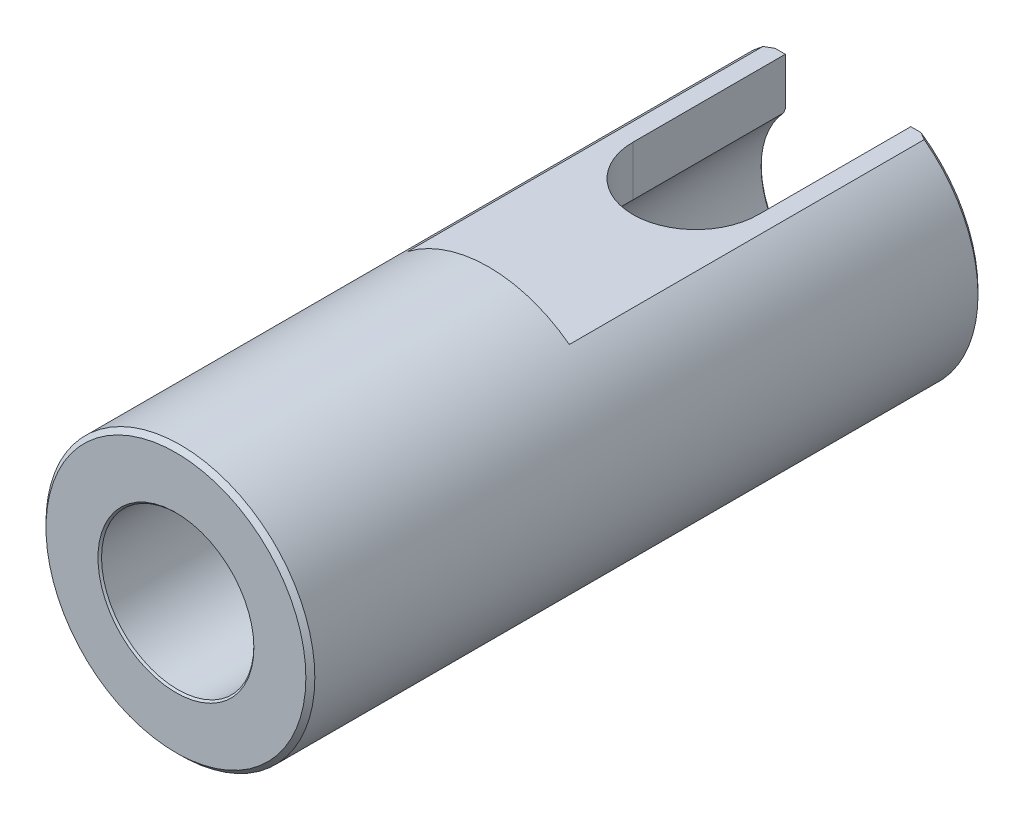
ISO-10303-21;
HEADER;
FILE_DESCRIPTION(('STEP AP214'),'2;1');
FILE_NAME('part.step','',(''),(''),'','','');
FILE_SCHEMA(('AUTOMOTIVE_DESIGN { 1 0 10303 214 1 1 1 1 }'));
ENDSEC;
DATA;
#1=APPLICATION_CONTEXT('core data for automotive mechanical design processes');
#2=APPLICATION_PROTOCOL_DEFINITION('international standard','automotive_design',2000,#1);
#3=PRODUCT_CONTEXT('',#1,'mechanical');
#4=PRODUCT('Part','Part','',(#3));
#5=PRODUCT_RELATED_PRODUCT_CATEGORY('part','',(#4));
#6=PRODUCT_DEFINITION_FORMATION('','',#4);
#7=PRODUCT_DEFINITION_CONTEXT('part definition',#1,'design');
#8=PRODUCT_DEFINITION('design','',#6,#7);
#9=PRODUCT_DEFINITION_SHAPE('','',#8);
#10=(LENGTH_UNIT() NAMED_UNIT(*) SI_UNIT(.MILLI.,.METRE.));
#11=(NAMED_UNIT(*) PLANE_ANGLE_UNIT() SI_UNIT($,.RADIAN.));
#12=(NAMED_UNIT(*) SI_UNIT($,.STERADIAN.) SOLID_ANGLE_UNIT());
#13=UNCERTAINTY_MEASURE_WITH_UNIT(LENGTH_MEASURE(1.E-05),#10,'distance_accuracy_value','');
#14=(GEOMETRIC_REPRESENTATION_CONTEXT(3) GLOBAL_UNCERTAINTY_ASSIGNED_CONTEXT((#13)) GLOBAL_UNIT_ASSIGNED_CONTEXT((#10,
#11,#12)) REPRESENTATION_CONTEXT('',''));
#15=CARTESIAN_POINT('',(0.,0.,0.));
#16=DIRECTION('',(0.,0.,1.));
#17=DIRECTION('',(1.,0.,0.));
#18=AXIS2_PLACEMENT_3D('',#15,#16,#17);
#19=CARTESIAN_POINT('',(0.,15.,-45.1779661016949));
#20=DIRECTION('',(0.,0.,-1.));
#21=DIRECTION('',(-1.,0.,0.));
#22=AXIS2_PLACEMENT_3D('',#19,#20,#21);
#23=PLANE('',#22);
#24=DIRECTION('',(0.,1.,0.));
#25=VECTOR('',#24,1.);
#26=CARTESIAN_POINT('',(-7.,-15.001,-45.1779661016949));
#27=LINE('',#26,#25);
#28=CARTESIAN_POINT('',(-7.,6.71490878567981,-45.1779661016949));
#29=VERTEX_POINT('',#28);
#30=CARTESIAN_POINT('',(-7.,12.,-45.1779661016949));
#31=VERTEX_POINT('',#30);
#32=EDGE_CURVE('E142',#29,#31,#27,.T.);
#33=ORIENTED_EDGE('',*,*,#32,.F.);
#34=CARTESIAN_POINT('',(0.,0.,-45.1779661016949));
#35=DIRECTION('',(0.,0.,-1.));
#36=DIRECTION('',(-1.,0.,0.));
#37=AXIS2_PLACEMENT_3D('',#34,#35,#36);
#38=CIRCLE('',#37,9.69999999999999);
#39=CARTESIAN_POINT('',(7.,6.71490878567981,-45.1779661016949));
#40=VERTEX_POINT('',#39);
#41=EDGE_CURVE('E135',#29,#40,#38,.F.);
#42=ORIENTED_EDGE('',*,*,#41,.T.);
#43=DIRECTION('',(0.,1.,0.));
#44=VECTOR('',#43,1.);
#45=CARTESIAN_POINT('',(7.,-15.001,-45.1779661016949));
#46=LINE('',#45,#44);
#47=CARTESIAN_POINT('',(7.,12.,-45.1779661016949));
#48=VERTEX_POINT('',#47);
#49=EDGE_CURVE('E120',#40,#48,#46,.T.);
#50=ORIENTED_EDGE('',*,*,#49,.T.);
#51=DIRECTION('',(1.,0.,0.));
#52=VECTOR('',#51,1.);
#53=CARTESIAN_POINT('',(-16.0903203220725,12.,-45.1779661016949));
#54=LINE('',#53,#52);
#55=CARTESIAN_POINT('',(8.13941029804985,12.,-45.1779661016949));
#56=VERTEX_POINT('',#55);
#57=EDGE_CURVE('E259',#48,#56,#54,.T.);
#58=ORIENTED_EDGE('',*,*,#57,.T.);
#59=CARTESIAN_POINT('',(0.,0.,-45.1779661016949));
#60=DIRECTION('',(0.,0.,-1.));
#61=DIRECTION('',(-1.,0.,0.));
#62=AXIS2_PLACEMENT_3D('',#59,#60,#61);
#63=CIRCLE('',#62,14.5);
#64=CARTESIAN_POINT('',(8.13941029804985,-12.,-45.1779661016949));
#65=VERTEX_POINT('',#64);
#66=EDGE_CURVE('E222',#56,#65,#63,.T.);
#67=ORIENTED_EDGE('',*,*,#66,.T.);
#68=DIRECTION('',(-1.,0.,0.));
#69=VECTOR('',#68,1.);
#70=CARTESIAN_POINT('',(-16.0903203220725,-12.,-45.1779661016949));
#71=LINE('',#70,#69);
#72=CARTESIAN_POINT('',(-8.13941029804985,-12.,-45.1779661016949));
#73=VERTEX_POINT('',#72);
#74=EDGE_CURVE('E252',#65,#73,#71,.T.);
#75=ORIENTED_EDGE('',*,*,#74,.T.);
#76=CARTESIAN_POINT('',(-8.13941029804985,12.,-45.1779661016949));
#77=VERTEX_POINT('',#76);
#78=EDGE_CURVE('E213',#73,#77,#63,.T.);
#79=ORIENTED_EDGE('',*,*,#78,.T.);
#80=EDGE_CURVE('E260',#77,#31,#54,.T.);
#81=ORIENTED_EDGE('',*,*,#80,.T.);
#82=EDGE_LOOP('',(#33,#42,#50,#58,#67,#75,#79,#81));
#83=FACE_BOUND('',#82,.T.);
#84=ADVANCED_FACE('F36',(#83),#23,.T.);
#85=CARTESIAN_POINT('',(0.,0.,0.));
#86=DIRECTION('',(0.,0.,-1.));
#87=DIRECTION('',(-1.,0.,0.));
#88=AXIS2_PLACEMENT_3D('',#85,#86,#87);
#89=CYLINDRICAL_SURFACE('',#88,15.);
#90=CARTESIAN_POINT('',(0.,0.,29.3220338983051));
#91=DIRECTION('',(0.,0.,1.));
#92=DIRECTION('',(1.,0.,0.));
#93=AXIS2_PLACEMENT_3D('',#90,#91,#92);
#94=CIRCLE('',#93,15.);
#95=CARTESIAN_POINT('',(15.,0.,29.3220338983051));
#96=VERTEX_POINT('',#95);
#97=EDGE_CURVE('E210',#96,#96,#94,.F.);
#98=ORIENTED_EDGE('',*,*,#97,.T.);
#99=EDGE_LOOP('',(#98));
#100=FACE_BOUND('',#99,.T.);
#101=CARTESIAN_POINT('',(0.,0.,-44.6779661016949));
#102=DIRECTION('',(0.,0.,-1.));
#103=DIRECTION('',(-1.,0.,0.));
#104=AXIS2_PLACEMENT_3D('',#101,#102,#103);
#105=CIRCLE('',#104,15.);
#106=CARTESIAN_POINT('',(8.99999999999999,-12.,-44.6779661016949));
#107=VERTEX_POINT('',#106);
#108=CARTESIAN_POINT('',(8.99999999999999,12.,-44.6779661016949));
#109=VERTEX_POINT('',#108);
#110=EDGE_CURVE('E211',#107,#109,#105,.F.);
#111=ORIENTED_EDGE('',*,*,#110,.T.);
#112=DIRECTION('',(0.,0.,-1.));
#113=VECTOR('',#112,1.);
#114=CARTESIAN_POINT('',(8.99999999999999,12.,0.));
#115=LINE('',#114,#113);
#116=CARTESIAN_POINT('',(8.99999999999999,12.,-5.07796610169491));
#117=VERTEX_POINT('',#116);
#118=EDGE_CURVE('E59',#109,#117,#115,.F.);
#119=ORIENTED_EDGE('',*,*,#118,.T.);
#120=CARTESIAN_POINT('',(0.,0.,-5.07796610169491));
#121=DIRECTION('',(0.,0.,1.));
#122=DIRECTION('',(1.,0.,0.));
#123=AXIS2_PLACEMENT_3D('',#120,#121,#122);
#124=CIRCLE('',#123,15.);
#125=CARTESIAN_POINT('',(-8.99999999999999,12.,-5.07796610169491));
#126=VERTEX_POINT('',#125);
#127=EDGE_CURVE('E12',#126,#117,#124,.F.);
#128=ORIENTED_EDGE('',*,*,#127,.F.);
#129=DIRECTION('',(0.,0.,-1.));
#130=VECTOR('',#129,1.);
#131=CARTESIAN_POINT('',(-8.99999999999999,12.,0.));
#132=LINE('',#131,#130);
#133=CARTESIAN_POINT('',(-8.99999999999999,12.,-44.6779661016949));
#134=VERTEX_POINT('',#133);
#135=EDGE_CURVE('E239',#126,#134,#132,.T.);
#136=ORIENTED_EDGE('',*,*,#135,.T.);
#137=CARTESIAN_POINT('',(-8.99999999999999,-12.,-44.6779661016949));
#138=VERTEX_POINT('',#137);
#139=EDGE_CURVE('E216',#134,#138,#105,.F.);
#140=ORIENTED_EDGE('',*,*,#139,.T.);
#141=DIRECTION('',(0.,0.,-1.));
#142=VECTOR('',#141,1.);
#143=CARTESIAN_POINT('',(-8.99999999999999,-12.,0.));
#144=LINE('',#143,#142);
#145=CARTESIAN_POINT('',(-8.99999999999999,-12.,-5.07796610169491));
#146=VERTEX_POINT('',#145);
#147=EDGE_CURVE('E248',#138,#146,#144,.F.);
#148=ORIENTED_EDGE('',*,*,#147,.T.);
#149=CARTESIAN_POINT('',(0.,0.,-5.07796610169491));
#150=DIRECTION('',(0.,0.,1.));
#151=DIRECTION('',(1.,0.,0.));
#152=AXIS2_PLACEMENT_3D('',#149,#150,#151);
#153=CIRCLE('',#152,15.);
#154=CARTESIAN_POINT('',(8.99999999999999,-12.,-5.07796610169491));
#155=VERTEX_POINT('',#154);
#156=EDGE_CURVE('E44',#155,#146,#153,.F.);
#157=ORIENTED_EDGE('',*,*,#156,.F.);
#158=DIRECTION('',(0.,0.,-1.));
#159=VECTOR('',#158,1.);
#160=CARTESIAN_POINT('',(8.99999999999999,-12.,0.));
#161=LINE('',#160,#159);
#162=EDGE_CURVE('E245',#155,#107,#161,.T.);
#163=ORIENTED_EDGE('',*,*,#162,.T.);
#164=EDGE_LOOP('',(#111,#119,#128,#136,#140,#148,#157,#163));
#165=FACE_BOUND('',#164,.T.);
#166=ADVANCED_FACE('F192',(#100,#165),#89,.T.);
#167=CARTESIAN_POINT('',(0.,0.,-45.1779661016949));
#168=DIRECTION('',(0.,0.,1.));
#169=DIRECTION('',(1.,0.,0.));
#170=AXIS2_PLACEMENT_3D('',#167,#168,#169);
#171=CONICAL_SURFACE('',#170,14.5,0.785398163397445);
#172=ORIENTED_EDGE('',*,*,#139,.F.);
#173=CARTESIAN_POINT('',(-30.7437505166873,12.,-26.6752662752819));
#174=CARTESIAN_POINT('',(-30.2743314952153,12.,-27.1125420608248));
#175=CARTESIAN_POINT('',(-29.8042635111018,12.,-27.5491228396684));
#176=CARTESIAN_POINT('',(-28.8626219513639,12.,-28.420663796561));
#177=CARTESIAN_POINT('',(-28.3910483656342,12.,-28.8556239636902));
#178=CARTESIAN_POINT('',(-27.4460881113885,12.,-29.7237847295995));
#179=CARTESIAN_POINT('',(-26.9727010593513,12.,-30.1569849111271));
#180=CARTESIAN_POINT('',(-26.0239654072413,12.,-31.0212311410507));
#181=CARTESIAN_POINT('',(-25.5486168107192,12.,-31.4522771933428));
#182=CARTESIAN_POINT('',(-24.5924854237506,12.,-32.3147160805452));
#183=CARTESIAN_POINT('',(-24.1116875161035,12.,-32.7460921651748));
#184=CARTESIAN_POINT('',(-23.1474197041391,12.,-33.6058475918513));
#185=CARTESIAN_POINT('',(-22.6639498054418,12.,-34.0342269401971));
#186=CARTESIAN_POINT('',(-21.6939335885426,12.,-34.8873735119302));
#187=CARTESIAN_POINT('',(-21.2073876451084,12.,-35.312141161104));
#188=CARTESIAN_POINT('',(-20.230594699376,12.,-36.1574006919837));
#189=CARTESIAN_POINT('',(-19.7403477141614,12.,-36.5778925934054));
#190=CARTESIAN_POINT('',(-18.8540514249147,12.,-37.3299934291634));
#191=CARTESIAN_POINT('',(-18.4587978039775,12.,-37.6625395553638));
#192=CARTESIAN_POINT('',(-17.6650184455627,12.,-38.3237016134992));
#193=CARTESIAN_POINT('',(-17.2664927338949,12.,-38.6523175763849));
#194=CARTESIAN_POINT('',(-16.4655068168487,12.,-39.3049697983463));
#195=CARTESIAN_POINT('',(-16.063045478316,12.,-39.6290046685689));
#196=CARTESIAN_POINT('',(-15.2536497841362,12.,-40.2714411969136));
#197=CARTESIAN_POINT('',(-14.8467154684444,12.,-40.5898429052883));
#198=CARTESIAN_POINT('',(-14.0281921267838,12.,-41.2193146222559));
#199=CARTESIAN_POINT('',(-13.6166111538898,12.,-41.5303950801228));
#200=CARTESIAN_POINT('',(-12.7871887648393,12.,-42.1441603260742));
#201=CARTESIAN_POINT('',(-12.3693470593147,12.,-42.4468447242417));
#202=CARTESIAN_POINT('',(-11.5264381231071,12.,-43.0415728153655));
#203=CARTESIAN_POINT('',(-11.1013745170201,12.,-43.3336216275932));
#204=CARTESIAN_POINT('',(-10.2424445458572,12.,-43.9044244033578));
#205=CARTESIAN_POINT('',(-9.80857934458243,12.,-44.1831801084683));
#206=CARTESIAN_POINT('',(-8.97031557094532,12.,-44.6990602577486));
#207=CARTESIAN_POINT('',(-8.56683183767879,12.,-44.9376641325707));
#208=CARTESIAN_POINT('',(-7.7497196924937,12.,-45.3970714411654));
#209=CARTESIAN_POINT('',(-7.33609018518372,12.,-45.6178729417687));
#210=CARTESIAN_POINT('',(-6.4975349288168,12.,-46.0366299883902));
#211=CARTESIAN_POINT('',(-6.07261386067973,12.,-46.2345948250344));
#212=CARTESIAN_POINT('',(-5.21032692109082,12.,-46.6014438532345));
#213=CARTESIAN_POINT('',(-4.77296425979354,12.,-46.770335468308));
#214=CARTESIAN_POINT('',(-3.97857447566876,12.,-47.0399170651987));
#215=CARTESIAN_POINT('',(-3.62389496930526,12.,-47.1474830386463));
#216=CARTESIAN_POINT('',(-2.90738987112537,12.,-47.3356189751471));
#217=CARTESIAN_POINT('',(-2.54556514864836,12.,-47.4161922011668));
#218=CARTESIAN_POINT('',(-1.8175785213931,12.,-47.5463593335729));
#219=CARTESIAN_POINT('',(-1.45143560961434,12.,-47.5960579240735));
#220=CARTESIAN_POINT('',(-0.716130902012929,12.,-47.6621908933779));
#221=CARTESIAN_POINT('',(-0.346969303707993,12.,-47.6786274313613));
#222=CARTESIAN_POINT('',(0.392521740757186,12.,-47.6772615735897));
#223=CARTESIAN_POINT('',(0.762850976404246,12.,-47.6593448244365));
#224=CARTESIAN_POINT('',(1.50034873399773,12.,-47.5901137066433));
#225=CARTESIAN_POINT('',(1.86751701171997,12.,-47.5387967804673));
#226=CARTESIAN_POINT('',(2.59732659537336,12.,-47.4053590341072));
#227=CARTESIAN_POINT('',(2.9599499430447,12.,-47.3231414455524));
#228=CARTESIAN_POINT('',(3.67793643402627,12.,-47.1317559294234));
#229=CARTESIAN_POINT('',(4.03329915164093,12.,-47.0225864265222));
#230=CARTESIAN_POINT('',(4.76833494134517,12.,-46.7703288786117));
#231=CARTESIAN_POINT('',(5.14724878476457,12.,-46.6250484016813));
#232=CARTESIAN_POINT('',(5.89581779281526,12.,-46.3121533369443));
#233=CARTESIAN_POINT('',(6.26546906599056,12.,-46.1445295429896));
#234=CARTESIAN_POINT('',(6.99656452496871,12.,-45.7909443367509));
#235=CARTESIAN_POINT('',(7.35799448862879,12.,-45.6049537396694));
#236=CARTESIAN_POINT('',(8.07284170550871,12.,-45.2183531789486));
#237=CARTESIAN_POINT('',(8.42625993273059,12.,-45.0177450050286));
#238=CARTESIAN_POINT('',(9.13057669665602,12.,-44.6019719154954));
#239=CARTESIAN_POINT('',(9.48138343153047,12.,-44.3866522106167));
#240=CARTESIAN_POINT('',(10.1766826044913,12.,-43.9460699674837));
#241=CARTESIAN_POINT('',(10.5211749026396,12.,-43.7208072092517));
#242=CARTESIAN_POINT('',(11.2043341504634,12.,-43.2623317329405));
#243=CARTESIAN_POINT('',(11.5430063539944,12.,-43.0291268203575));
#244=CARTESIAN_POINT('',(12.2155761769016,12.,-42.55595635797));
#245=CARTESIAN_POINT('',(12.5494738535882,12.,-42.3159908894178));
#246=CARTESIAN_POINT('',(13.2908932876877,12.,-41.7735020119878));
#247=CARTESIAN_POINT('',(13.6973301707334,12.,-41.4694976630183));
#248=CARTESIAN_POINT('',(14.5048836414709,12.,-40.8544907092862));
#249=CARTESIAN_POINT('',(14.9060000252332,12.,-40.5434878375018));
#250=CARTESIAN_POINT('',(15.7037621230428,12.,-39.9156895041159));
#251=CARTESIAN_POINT('',(16.1004071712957,12.,-39.5988931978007));
#252=CARTESIAN_POINT('',(16.8898244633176,12.,-38.9605271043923));
#253=CARTESIAN_POINT('',(17.2825967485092,12.,-38.6389573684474));
#254=CARTESIAN_POINT('',(18.0652259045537,12.,-37.9914723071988));
#255=CARTESIAN_POINT('',(18.455079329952,12.,-37.6655528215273));
#256=CARTESIAN_POINT('',(19.231910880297,12.,-37.0103029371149));
#257=CARTESIAN_POINT('',(19.6188889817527,12.,-36.6809725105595));
#258=CARTESIAN_POINT('',(20.7761100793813,12.,-35.688621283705));
#259=CARTESIAN_POINT('',(21.5426265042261,12.,-35.0212516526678));
#260=CARTESIAN_POINT('',(22.6624106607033,12.,-34.0351009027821));
#261=CARTESIAN_POINT('',(23.0186578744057,12.,-33.7196860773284));
#262=CARTESIAN_POINT('',(23.7296509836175,12.,-33.0871797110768));
#263=CARTESIAN_POINT('',(24.0843969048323,12.,-32.7700881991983));
#264=CARTESIAN_POINT('',(25.1466639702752,12.,-31.8165748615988));
#265=CARTESIAN_POINT('',(25.8521927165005,12.,-31.1779333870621));
#266=CARTESIAN_POINT('',(27.257384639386,12.,-29.8974085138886));
#267=CARTESIAN_POINT('',(27.9570574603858,12.,-29.255535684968));
#268=CARTESIAN_POINT('',(29.0039346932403,12.,-28.28990919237));
#269=CARTESIAN_POINT('',(29.3524469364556,12.,-27.9675717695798));
#270=CARTESIAN_POINT('',(30.0486759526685,12.,-27.3220401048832));
#271=CARTESIAN_POINT('',(30.3963927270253,12.,-26.9988458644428));
#272=CARTESIAN_POINT('',(30.7437505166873,12.,-26.6752662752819));
#273=B_SPLINE_CURVE_WITH_KNOTS('',3,(#173,#174,#175,#176,#177,#178,#179,#180,#181,#182,#183,
#184,#185,#186,#187,#188,#189,#190,#191,#192,#193,#194,#195,#196,#197,#198,#199,#200,#201,#202,
#203,#204,#205,#206,#207,#208,#209,#210,#211,#212,#213,#214,#215,#216,#217,#218,#219,#220,#221,
#222,#223,#224,#225,#226,#227,#228,#229,#230,#231,#232,#233,#234,#235,#236,#237,#238,#239,#240,
#241,#242,#243,#244,#245,#246,#247,#248,#249,#250,#251,#252,#253,#254,#255,#256,#257,#258,#259,
#260,#261,#262,#263,#264,#265,#266,#267,#268,#269,#270,#271,#272),.UNSPECIFIED.,.F.,.F.,(4,2,2,
2,2,2,2,2,2,2,2,2,2,2,2,2,2,2,2,2,2,2,2,2,2,2,2,2,2,2,2,2,2,2,2,2,2,2,2,2,2,2,2,2,2,2,2,2,2,4),
(0.,1.92459937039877,3.84921168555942,5.77425637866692,7.69929758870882,9.63713833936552,
11.5749750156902,13.5125799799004,15.4501760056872,16.9997715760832,18.5493549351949,
20.0993984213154,21.649428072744,23.1970917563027,24.7448271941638,26.2918075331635,
27.8385846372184,29.2444968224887,30.6505614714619,32.0560520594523,33.4611832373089,
34.5721859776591,35.6830543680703,36.7901353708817,37.8971445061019,39.0078449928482,
40.1186305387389,41.2329239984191,42.3472826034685,43.5638355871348,44.7808913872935,
45.9999131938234,47.2187859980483,48.4534330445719,49.6881074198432,50.9216015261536,
52.1550808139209,53.6776414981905,55.2002603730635,56.7231030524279,58.2459294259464,
59.7703348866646,61.2947527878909,64.3436407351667,65.7710791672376,67.1984930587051,
70.0534076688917,72.9018790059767,74.3260476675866,75.7502138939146),.UNSPECIFIED.);
#274=EDGE_CURVE('E329',#134,#77,#273,.T.);
#275=ORIENTED_EDGE('',*,*,#274,.T.);
#276=ORIENTED_EDGE('',*,*,#78,.F.);
#277=CARTESIAN_POINT('',(30.7437505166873,-12.,-26.6752662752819));
#278=CARTESIAN_POINT('',(30.2743314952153,-12.,-27.1125420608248));
#279=CARTESIAN_POINT('',(29.8042635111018,-12.,-27.5491228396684));
#280=CARTESIAN_POINT('',(28.8626219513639,-12.,-28.420663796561));
#281=CARTESIAN_POINT('',(28.3910483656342,-12.,-28.8556239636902));
#282=CARTESIAN_POINT('',(27.4460881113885,-12.,-29.7237847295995));
#283=CARTESIAN_POINT('',(26.9727010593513,-12.,-30.1569849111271));
#284=CARTESIAN_POINT('',(26.0239654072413,-12.,-31.0212311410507));
#285=CARTESIAN_POINT('',(25.5486168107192,-12.,-31.4522771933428));
#286=CARTESIAN_POINT('',(24.5924854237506,-12.,-32.3147160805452));
#287=CARTESIAN_POINT('',(24.1116875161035,-12.,-32.7460921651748));
#288=CARTESIAN_POINT('',(23.1474197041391,-12.,-33.6058475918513));
#289=CARTESIAN_POINT('',(22.6639498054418,-12.,-34.0342269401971));
#290=CARTESIAN_POINT('',(21.6939335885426,-12.,-34.8873735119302));
#291=CARTESIAN_POINT('',(21.2073876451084,-12.,-35.312141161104));
#292=CARTESIAN_POINT('',(20.230594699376,-12.,-36.1574006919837));
#293=CARTESIAN_POINT('',(19.7403477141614,-12.,-36.5778925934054));
#294=CARTESIAN_POINT('',(18.8540514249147,-12.,-37.3299934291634));
#295=CARTESIAN_POINT('',(18.4587978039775,-12.,-37.6625395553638));
#296=CARTESIAN_POINT('',(17.6650184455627,-12.,-38.3237016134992));
#297=CARTESIAN_POINT('',(17.2664927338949,-12.,-38.6523175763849));
#298=CARTESIAN_POINT('',(16.4655068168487,-12.,-39.3049697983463));
#299=CARTESIAN_POINT('',(16.063045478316,-12.,-39.6290046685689));
#300=CARTESIAN_POINT('',(15.2536497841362,-12.,-40.2714411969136));
#301=CARTESIAN_POINT('',(14.8467154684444,-12.,-40.5898429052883));
#302=CARTESIAN_POINT('',(14.0281921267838,-12.,-41.2193146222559));
#303=CARTESIAN_POINT('',(13.6166111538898,-12.,-41.5303950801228));
#304=CARTESIAN_POINT('',(12.7871887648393,-12.,-42.1441603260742));
#305=CARTESIAN_POINT('',(12.3693470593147,-12.,-42.4468447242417));
#306=CARTESIAN_POINT('',(11.5264381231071,-12.,-43.0415728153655));
#307=CARTESIAN_POINT('',(11.1013745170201,-12.,-43.3336216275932));
#308=CARTESIAN_POINT('',(10.2424445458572,-12.,-43.9044244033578));
#309=CARTESIAN_POINT('',(9.80857934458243,-12.,-44.1831801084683));
#310=CARTESIAN_POINT('',(8.97031557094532,-12.,-44.6990602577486));
#311=CARTESIAN_POINT('',(8.56683183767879,-12.,-44.9376641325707));
#312=CARTESIAN_POINT('',(7.7497196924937,-12.,-45.3970714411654));
#313=CARTESIAN_POINT('',(7.33609018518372,-12.,-45.6178729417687));
#314=CARTESIAN_POINT('',(6.4975349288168,-12.,-46.0366299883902));
#315=CARTESIAN_POINT('',(6.07261386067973,-12.,-46.2345948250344));
#316=CARTESIAN_POINT('',(5.21032692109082,-12.,-46.6014438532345));
#317=CARTESIAN_POINT('',(4.77296425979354,-12.,-46.770335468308));
#318=CARTESIAN_POINT('',(3.97857447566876,-12.,-47.0399170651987));
#319=CARTESIAN_POINT('',(3.62389496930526,-12.,-47.1474830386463));
#320=CARTESIAN_POINT('',(2.90738987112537,-12.,-47.3356189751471));
#321=CARTESIAN_POINT('',(2.54556514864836,-12.,-47.4161922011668));
#322=CARTESIAN_POINT('',(1.8175785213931,-12.,-47.5463593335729));
#323=CARTESIAN_POINT('',(1.45143560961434,-12.,-47.5960579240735));
#324=CARTESIAN_POINT('',(0.716130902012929,-12.,-47.6621908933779));
#325=CARTESIAN_POINT('',(0.346969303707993,-12.,-47.6786274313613));
#326=CARTESIAN_POINT('',(-0.392521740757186,-12.,-47.6772615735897));
#327=CARTESIAN_POINT('',(-0.762850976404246,-12.,-47.6593448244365));
#328=CARTESIAN_POINT('',(-1.50034873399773,-12.,-47.5901137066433));
#329=CARTESIAN_POINT('',(-1.86751701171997,-12.,-47.5387967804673));
#330=CARTESIAN_POINT('',(-2.59732659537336,-12.,-47.4053590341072));
#331=CARTESIAN_POINT('',(-2.9599499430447,-12.,-47.3231414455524));
#332=CARTESIAN_POINT('',(-3.67793643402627,-12.,-47.1317559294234));
#333=CARTESIAN_POINT('',(-4.03329915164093,-12.,-47.0225864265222));
#334=CARTESIAN_POINT('',(-4.76833494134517,-12.,-46.7703288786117));
#335=CARTESIAN_POINT('',(-5.14724878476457,-12.,-46.6250484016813));
#336=CARTESIAN_POINT('',(-5.89581779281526,-12.,-46.3121533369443));
#337=CARTESIAN_POINT('',(-6.26546906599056,-12.,-46.1445295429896));
#338=CARTESIAN_POINT('',(-6.99656452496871,-12.,-45.7909443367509));
#339=CARTESIAN_POINT('',(-7.35799448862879,-12.,-45.6049537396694));
#340=CARTESIAN_POINT('',(-8.07284170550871,-12.,-45.2183531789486));
#341=CARTESIAN_POINT('',(-8.42625993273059,-12.,-45.0177450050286));
#342=CARTESIAN_POINT('',(-9.13057669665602,-12.,-44.6019719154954));
#343=CARTESIAN_POINT('',(-9.48138343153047,-12.,-44.3866522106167));
#344=CARTESIAN_POINT('',(-10.1766826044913,-12.,-43.9460699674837));
#345=CARTESIAN_POINT('',(-10.5211749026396,-12.,-43.7208072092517));
#346=CARTESIAN_POINT('',(-11.2043341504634,-12.,-43.2623317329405));
#347=CARTESIAN_POINT('',(-11.5430063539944,-12.,-43.0291268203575));
#348=CARTESIAN_POINT('',(-12.2155761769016,-12.,-42.55595635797));
#349=CARTESIAN_POINT('',(-12.5494738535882,-12.,-42.3159908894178));
#350=CARTESIAN_POINT('',(-13.2908932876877,-12.,-41.7735020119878));
#351=CARTESIAN_POINT('',(-13.6973301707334,-12.,-41.4694976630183));
#352=CARTESIAN_POINT('',(-14.5048836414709,-12.,-40.8544907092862));
#353=CARTESIAN_POINT('',(-14.9060000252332,-12.,-40.5434878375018));
#354=CARTESIAN_POINT('',(-15.7037621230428,-12.,-39.9156895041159));
#355=CARTESIAN_POINT('',(-16.1004071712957,-12.,-39.5988931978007));
#356=CARTESIAN_POINT('',(-16.8898244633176,-12.,-38.9605271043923));
#357=CARTESIAN_POINT('',(-17.2825967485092,-12.,-38.6389573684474));
#358=CARTESIAN_POINT('',(-18.0652259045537,-12.,-37.9914723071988));
#359=CARTESIAN_POINT('',(-18.455079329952,-12.,-37.6655528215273));
#360=CARTESIAN_POINT('',(-19.231910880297,-12.,-37.0103029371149));
#361=CARTESIAN_POINT('',(-19.6188889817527,-12.,-36.6809725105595));
#362=CARTESIAN_POINT('',(-20.7761100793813,-12.,-35.688621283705));
#363=CARTESIAN_POINT('',(-21.5426265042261,-12.,-35.0212516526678));
#364=CARTESIAN_POINT('',(-22.6624106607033,-12.,-34.0351009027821));
#365=CARTESIAN_POINT('',(-23.0186578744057,-12.,-33.7196860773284));
#366=CARTESIAN_POINT('',(-23.7296509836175,-12.,-33.0871797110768));
#367=CARTESIAN_POINT('',(-24.0843969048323,-12.,-32.7700881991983));
#368=CARTESIAN_POINT('',(-25.1466639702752,-12.,-31.8165748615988));
#369=CARTESIAN_POINT('',(-25.8521927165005,-12.,-31.1779333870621));
#370=CARTESIAN_POINT('',(-27.257384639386,-12.,-29.8974085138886));
#371=CARTESIAN_POINT('',(-27.9570574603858,-12.,-29.255535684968));
#372=CARTESIAN_POINT('',(-29.0039346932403,-12.,-28.28990919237));
#373=CARTESIAN_POINT('',(-29.3524469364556,-12.,-27.9675717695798));
#374=CARTESIAN_POINT('',(-30.0486759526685,-12.,-27.3220401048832));
#375=CARTESIAN_POINT('',(-30.3963927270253,-12.,-26.9988458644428));
#376=CARTESIAN_POINT('',(-30.7437505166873,-12.,-26.6752662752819));
#377=B_SPLINE_CURVE_WITH_KNOTS('',3,(#277,#278,#279,#280,#281,#282,#283,#284,#285,#286,#287,
#288,#289,#290,#291,#292,#293,#294,#295,#296,#297,#298,#299,#300,#301,#302,#303,#304,#305,#306,
#307,#308,#309,#310,#311,#312,#313,#314,#315,#316,#317,#318,#319,#320,#321,#322,#323,#324,#325,
#326,#327,#328,#329,#330,#331,#332,#333,#334,#335,#336,#337,#338,#339,#340,#341,#342,#343,#344,
#345,#346,#347,#348,#349,#350,#351,#352,#353,#354,#355,#356,#357,#358,#359,#360,#361,#362,#363,
#364,#365,#366,#367,#368,#369,#370,#371,#372,#373,#374,#375,#376),.UNSPECIFIED.,.F.,.F.,(4,2,2,
2,2,2,2,2,2,2,2,2,2,2,2,2,2,2,2,2,2,2,2,2,2,2,2,2,2,2,2,2,2,2,2,2,2,2,2,2,2,2,2,2,2,2,2,2,2,4),
(0.,1.92459937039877,3.84921168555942,5.77425637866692,7.69929758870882,9.63713833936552,
11.5749750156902,13.5125799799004,15.4501760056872,16.9997715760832,18.5493549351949,
20.0993984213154,21.649428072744,23.1970917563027,24.7448271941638,26.2918075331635,
27.8385846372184,29.2444968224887,30.6505614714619,32.0560520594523,33.4611832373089,
34.5721859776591,35.6830543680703,36.7901353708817,37.8971445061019,39.0078449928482,
40.1186305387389,41.2329239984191,42.3472826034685,43.5638355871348,44.7808913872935,
45.9999131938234,47.2187859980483,48.4534330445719,49.6881074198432,50.9216015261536,
52.1550808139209,53.6776414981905,55.2002603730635,56.7231030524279,58.2459294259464,
59.7703348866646,61.2947527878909,64.3436407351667,65.7710791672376,67.1984930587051,
70.0534076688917,72.9018790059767,74.3260476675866,75.7502138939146),.UNSPECIFIED.);
#378=EDGE_CURVE('E143',#73,#138,#377,.T.);
#379=ORIENTED_EDGE('',*,*,#378,.T.);
#380=EDGE_LOOP('',(#172,#275,#276,#379));
#381=FACE_BOUND('',#380,.T.);
#382=ADVANCED_FACE('F164',(#381),#171,.T.);
#383=ORIENTED_EDGE('',*,*,#66,.F.);
#384=EDGE_CURVE('E158',#56,#109,#273,.T.);
#385=ORIENTED_EDGE('',*,*,#384,.T.);
#386=ORIENTED_EDGE('',*,*,#110,.F.);
#387=EDGE_CURVE('E146',#107,#65,#377,.T.);
#388=ORIENTED_EDGE('',*,*,#387,.T.);
#389=EDGE_LOOP('',(#383,#385,#386,#388));
#390=FACE_BOUND('',#389,.T.);
#391=ADVANCED_FACE('F190',(#390),#171,.T.);
#392=CARTESIAN_POINT('',(0.,8.5,29.8220338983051));
#393=DIRECTION('',(0.,0.,1.));
#394=DIRECTION('',(1.,0.,0.));
#395=AXIS2_PLACEMENT_3D('',#392,#393,#394);
#396=PLANE('',#395);
#397=CARTESIAN_POINT('',(0.,0.,29.8220338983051));
#398=DIRECTION('',(0.,0.,1.));
#399=DIRECTION('',(1.,0.,0.));
#400=AXIS2_PLACEMENT_3D('',#397,#398,#399);
#401=CIRCLE('',#400,8.69999999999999);
#402=CARTESIAN_POINT('',(8.69999999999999,0.,29.8220338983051));
#403=VERTEX_POINT('',#402);
#404=EDGE_CURVE('E223',#403,#403,#401,.F.);
#405=ORIENTED_EDGE('',*,*,#404,.T.);
#406=EDGE_LOOP('',(#405));
#407=FACE_BOUND('',#406,.T.);
#408=CARTESIAN_POINT('',(0.,0.,29.8220338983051));
#409=DIRECTION('',(0.,0.,1.));
#410=DIRECTION('',(1.,0.,0.));
#411=AXIS2_PLACEMENT_3D('',#408,#409,#410);
#412=CIRCLE('',#411,14.5);
#413=CARTESIAN_POINT('',(14.5,0.,29.8220338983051));
#414=VERTEX_POINT('',#413);
#415=EDGE_CURVE('E207',#414,#414,#412,.T.);
#416=ORIENTED_EDGE('',*,*,#415,.T.);
#417=EDGE_LOOP('',(#416));
#418=FACE_BOUND('',#417,.T.);
#419=ADVANCED_FACE('F186',(#407,#418),#396,.T.);
#420=CARTESIAN_POINT('',(0.,0.,0.));
#421=DIRECTION('',(0.,0.,-1.));
#422=DIRECTION('',(-1.,0.,0.));
#423=AXIS2_PLACEMENT_3D('',#420,#421,#422);
#424=CYLINDRICAL_SURFACE('',#423,8.5);
#425=CARTESIAN_POINT('',(0.,-8.5,-16.8279661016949));
#426=CARTESIAN_POINT('',(-0.0917578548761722,-8.49999832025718,-16.8279626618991));
#427=CARTESIAN_POINT('',(-0.183559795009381,-8.49849891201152,-16.8202861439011));
#428=CARTESIAN_POINT('',(-0.36457260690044,-8.49266205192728,-16.7898050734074));
#429=CARTESIAN_POINT('',(-0.453781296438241,-8.4883222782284,-16.7669881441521));
#430=CARTESIAN_POINT('',(-0.626963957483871,-8.4772896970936,-16.706954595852));
#431=CARTESIAN_POINT('',(-0.710942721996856,-8.47059908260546,-16.6697513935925));
#432=CARTESIAN_POINT('',(-0.871459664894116,-8.45559371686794,-16.5820403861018));
#433=CARTESIAN_POINT('',(-0.947998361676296,-8.4472790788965,-16.5315335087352));
#434=CARTESIAN_POINT('',(-1.09244852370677,-8.42982308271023,-16.4179633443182));
#435=CARTESIAN_POINT('',(-1.16025105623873,-8.42067334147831,-16.3547627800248));
#436=CARTESIAN_POINT('',(-1.28436139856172,-8.40263994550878,-16.2178944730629));
#437=CARTESIAN_POINT('',(-1.34066834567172,-8.39375631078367,-16.1442259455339));
#438=CARTESIAN_POINT('',(-1.44064777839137,-8.37717929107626,-15.9877358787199));
#439=CARTESIAN_POINT('',(-1.4842084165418,-8.36949670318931,-15.9048416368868));
#440=CARTESIAN_POINT('',(-1.55674242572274,-8.35631024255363,-15.7327371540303));
#441=CARTESIAN_POINT('',(-1.58571714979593,-8.3508061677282,-15.6435274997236));
#442=CARTESIAN_POINT('',(-1.62790512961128,-8.34268453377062,-15.4624934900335));
#443=CARTESIAN_POINT('',(-1.6413089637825,-8.34003210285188,-15.3707151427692));
#444=CARTESIAN_POINT('',(-1.65256643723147,-8.3378090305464,-15.1861768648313));
#445=CARTESIAN_POINT('',(-1.6504215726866,-8.33823809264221,-15.0934170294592));
#446=CARTESIAN_POINT('',(-1.63079683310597,-8.34209781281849,-14.9109366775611));
#447=CARTESIAN_POINT('',(-1.6135345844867,-8.34548587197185,-14.8211917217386));
#448=CARTESIAN_POINT('',(-1.56450822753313,-8.35481484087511,-14.6458963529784));
#449=CARTESIAN_POINT('',(-1.53274346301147,-8.36075586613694,-14.5603461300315));
#450=CARTESIAN_POINT('',(-1.45540355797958,-8.37456538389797,-14.3952369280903));
#451=CARTESIAN_POINT('',(-1.40974138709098,-8.38244596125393,-14.3157197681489));
#452=CARTESIAN_POINT('',(-1.305964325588,-8.39923877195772,-14.1653944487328));
#453=CARTESIAN_POINT('',(-1.24784808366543,-8.40815111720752,-14.0945872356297));
#454=CARTESIAN_POINT('',(-1.11964348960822,-8.4261883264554,-13.9624352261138));
#455=CARTESIAN_POINT('',(-1.04936920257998,-8.43531423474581,-13.9012708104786));
#456=CARTESIAN_POINT('',(-0.899463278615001,-8.45261198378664,-13.7915707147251));
#457=CARTESIAN_POINT('',(-0.819831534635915,-8.46078381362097,-13.7430351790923));
#458=CARTESIAN_POINT('',(-0.653276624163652,-8.47527099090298,-13.6599404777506));
#459=CARTESIAN_POINT('',(-0.566343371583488,-8.48158371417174,-13.6254010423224));
#460=CARTESIAN_POINT('',(-0.387758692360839,-8.49162132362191,-13.5714665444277));
#461=CARTESIAN_POINT('',(-0.296107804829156,-8.4953465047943,-13.5520697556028));
#462=CARTESIAN_POINT('',(-0.112240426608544,-8.49974848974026,-13.5292244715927));
#463=CARTESIAN_POINT('',(-0.020055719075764,-8.50047249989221,-13.5255289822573));
#464=CARTESIAN_POINT('',(0.163614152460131,-8.49892134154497,-13.533527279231));
#465=CARTESIAN_POINT('',(0.255099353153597,-8.49664633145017,-13.5452202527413));
#466=CARTESIAN_POINT('',(0.433982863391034,-8.48938222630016,-13.5834582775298));
#467=CARTESIAN_POINT('',(0.521409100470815,-8.48441614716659,-13.6098774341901));
#468=CARTESIAN_POINT('',(0.69059104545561,-8.47232456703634,-13.6766809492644));
#469=CARTESIAN_POINT('',(0.772346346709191,-8.46519891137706,-13.7170663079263));
#470=CARTESIAN_POINT('',(0.928913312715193,-8.44946090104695,-13.8111960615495));
#471=CARTESIAN_POINT('',(1.00363326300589,-8.44083223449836,-13.8650902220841));
#472=CARTESIAN_POINT('',(1.14305740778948,-8.42308543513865,-13.9845061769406));
#473=CARTESIAN_POINT('',(1.20776059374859,-8.4139672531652,-14.05002914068));
#474=CARTESIAN_POINT('',(1.32626076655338,-8.3961111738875,-14.1919642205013));
#475=CARTESIAN_POINT('',(1.37988866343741,-8.38738057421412,-14.2685185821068));
#476=CARTESIAN_POINT('',(1.47352438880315,-8.3714390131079,-14.429694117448));
#477=CARTESIAN_POINT('',(1.5135327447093,-8.36422799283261,-14.5143149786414));
#478=CARTESIAN_POINT('',(1.57855858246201,-8.35220018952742,-14.6888069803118));
#479=CARTESIAN_POINT('',(1.60365129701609,-8.34737141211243,-14.7786492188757));
#480=CARTESIAN_POINT('',(1.63836363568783,-8.34062844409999,-14.9613778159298));
#481=CARTESIAN_POINT('',(1.64798514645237,-8.33871389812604,-15.0542638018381));
#482=CARTESIAN_POINT('',(1.65141531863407,-8.33803508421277,-15.2387474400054));
#483=CARTESIAN_POINT('',(1.64549094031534,-8.3392176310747,-15.3303400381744));
#484=CARTESIAN_POINT('',(1.61858443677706,-8.34448135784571,-15.5111968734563));
#485=CARTESIAN_POINT('',(1.59760241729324,-8.34856251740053,-15.6004611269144));
#486=CARTESIAN_POINT('',(1.54129226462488,-8.35914050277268,-15.7739700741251));
#487=CARTESIAN_POINT('',(1.50599504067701,-8.36563212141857,-15.858225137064));
#488=CARTESIAN_POINT('',(1.42208637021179,-8.38030288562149,-16.019659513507));
#489=CARTESIAN_POINT('',(1.37347389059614,-8.38848216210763,-16.096838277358));
#490=CARTESIAN_POINT('',(1.26339503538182,-8.40577050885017,-16.2432623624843));
#491=CARTESIAN_POINT('',(1.20173514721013,-8.41489237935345,-16.3123607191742));
#492=CARTESIAN_POINT('',(1.06771324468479,-8.43294439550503,-16.4393185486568));
#493=CARTESIAN_POINT('',(0.995348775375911,-8.44187449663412,-16.4971754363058));
#494=CARTESIAN_POINT('',(0.841124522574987,-8.4586392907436,-16.6005384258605));
#495=CARTESIAN_POINT('',(0.759178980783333,-8.46646244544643,-16.6459185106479));
#496=CARTESIAN_POINT('',(0.588698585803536,-8.48001878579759,-16.7221933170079));
#497=CARTESIAN_POINT('',(0.500169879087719,-8.48575389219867,-16.7531013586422));
#498=CARTESIAN_POINT('',(0.342843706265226,-8.49334735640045,-16.7934297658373));
#499=CARTESIAN_POINT('',(0.274953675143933,-8.49582774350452,-16.8063582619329));
#500=CARTESIAN_POINT('',(0.13805072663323,-8.49915467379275,-16.8236276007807));
#501=CARTESIAN_POINT('',(0.0690378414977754,-8.50000126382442,-16.8279686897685));
#502=CARTESIAN_POINT('',(0.,-8.5,-16.8279661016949));
#503=B_SPLINE_CURVE_WITH_KNOTS('',3,(#425,#426,#427,#428,#429,#430,#431,#432,#433,#434,#435,
#436,#437,#438,#439,#440,#441,#442,#443,#444,#445,#446,#447,#448,#449,#450,#451,#452,#453,#454,
#455,#456,#457,#458,#459,#460,#461,#462,#463,#464,#465,#466,#467,#468,#469,#470,#471,#472,#473,
#474,#475,#476,#477,#478,#479,#480,#481,#482,#483,#484,#485,#486,#487,#488,#489,#490,#491,#492,
#493,#494,#495,#496,#497,#498,#499,#500,#501,#502),.UNSPECIFIED.,.T.,.F.,(4,2,2,2,2,2,2,2,2,2,2,
2,2,2,2,2,2,2,2,2,2,2,2,2,2,2,2,2,2,2,2,2,2,2,2,2,2,2,4),(0.,0.275021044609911,
0.550267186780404,0.825257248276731,1.10022813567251,1.37835052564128,1.65649377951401,
1.93700915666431,2.2174985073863,2.49451740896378,2.77150965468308,3.04457874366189,
3.31766018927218,3.59248823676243,3.86734611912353,4.14685472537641,4.42636652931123,
4.70627100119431,4.9861435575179,5.26159680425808,5.53703550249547,5.81015480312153,
6.0832936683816,6.3596061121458,6.63594635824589,6.91623610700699,7.19651500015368,
7.47536793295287,7.75418685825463,8.02824925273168,8.30230972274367,8.57578156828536,
8.84927463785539,9.12715073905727,9.40509066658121,9.68574250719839,9.96613552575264,
10.1730649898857,10.3799885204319),.UNSPECIFIED.);
#504=CARTESIAN_POINT('',(0.,-8.5,-16.8279661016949));
#505=VERTEX_POINT('',#504);
#506=EDGE_CURVE('E272',#505,#505,#503,.T.);
#507=ORIENTED_EDGE('',*,*,#506,.F.);
#508=EDGE_LOOP('',(#507));
#509=FACE_BOUND('',#508,.T.);
#510=CARTESIAN_POINT('',(0.,0.,29.6220338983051));
#511=DIRECTION('',(0.,0.,1.));
#512=DIRECTION('',(1.,0.,0.));
#513=AXIS2_PLACEMENT_3D('',#510,#511,#512);
#514=CIRCLE('',#513,8.5);
#515=CARTESIAN_POINT('',(8.5,0.,29.6220338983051));
#516=VERTEX_POINT('',#515);
#517=EDGE_CURVE('E148',#516,#516,#514,.T.);
#518=ORIENTED_EDGE('',*,*,#517,.T.);
#519=EDGE_LOOP('',(#518));
#520=FACE_BOUND('',#519,.T.);
#521=CARTESIAN_POINT('',(0.,0.,-20.1779661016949));
#522=DIRECTION('',(0.,0.,-1.));
#523=DIRECTION('',(-1.,0.,0.));
#524=AXIS2_PLACEMENT_3D('',#521,#522,#523);
#525=CIRCLE('',#524,8.5);
#526=CARTESIAN_POINT('',(-8.5,0.,-20.1779661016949));
#527=VERTEX_POINT('',#526);
#528=EDGE_CURVE('E234',#527,#527,#525,.T.);
#529=ORIENTED_EDGE('',*,*,#528,.T.);
#530=EDGE_LOOP('',(#529));
#531=FACE_BOUND('',#530,.T.);
#532=ADVANCED_FACE('F182',(#509,#520,#531),#424,.F.);
#533=CARTESIAN_POINT('',(0.,8.5,-20.1779661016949));
#534=DIRECTION('',(0.,0.,-1.));
#535=DIRECTION('',(-1.,0.,0.));
#536=AXIS2_PLACEMENT_3D('',#533,#534,#535);
#537=PLANE('',#536);
#538=CARTESIAN_POINT('',(0.,0.,-20.1779661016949));
#539=DIRECTION('',(0.,0.,-1.));
#540=DIRECTION('',(-1.,0.,0.));
#541=AXIS2_PLACEMENT_3D('',#538,#539,#540);
#542=CIRCLE('',#541,9.5);
#543=CARTESIAN_POINT('',(-9.5,0.,-20.1779661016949));
#544=VERTEX_POINT('',#543);
#545=EDGE_CURVE('E236',#544,#544,#542,.T.);
#546=ORIENTED_EDGE('',*,*,#545,.T.);
#547=EDGE_LOOP('',(#546));
#548=FACE_BOUND('',#547,.T.);
#549=ORIENTED_EDGE('',*,*,#528,.F.);
#550=EDGE_LOOP('',(#549));
#551=FACE_BOUND('',#550,.T.);
#552=ADVANCED_FACE('F178',(#548,#551),#537,.T.);
#553=CARTESIAN_POINT('',(0.,0.,0.));
#554=DIRECTION('',(0.,0.,-1.));
#555=DIRECTION('',(-1.,0.,0.));
#556=AXIS2_PLACEMENT_3D('',#553,#554,#555);
#557=CYLINDRICAL_SURFACE('',#556,9.5);
#558=DIRECTION('',(0.,0.,-1.));
#559=VECTOR('',#558,1.);
#560=CARTESIAN_POINT('',(-6.99999999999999,6.42261628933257,0.));
#561=LINE('',#560,#559);
#562=CARTESIAN_POINT('',(-7.,6.42261628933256,-44.9779661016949));
#563=VERTEX_POINT('',#562);
#564=CARTESIAN_POINT('',(-7.,6.42261628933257,-28.1779661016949));
#565=VERTEX_POINT('',#564);
#566=EDGE_CURVE('E271',#563,#565,#561,.F.);
#567=ORIENTED_EDGE('',*,*,#566,.T.);
#568=CARTESIAN_POINT('',(-7.,6.42261628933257,-28.1779661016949));
#569=CARTESIAN_POINT('',(-7.00000181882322,6.42261067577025,-28.0948877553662));
#570=CARTESIAN_POINT('',(-6.99852050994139,6.42422917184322,-28.0118253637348));
#571=CARTESIAN_POINT('',(-6.99261351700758,6.43065972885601,-27.8459415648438));
#572=CARTESIAN_POINT('',(-6.98818828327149,6.43547130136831,-27.7631201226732));
#573=CARTESIAN_POINT('',(-6.97055469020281,6.45458638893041,-27.5156556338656));
#574=CARTESIAN_POINT('',(-6.95298822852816,6.47357075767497,-27.3516456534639));
#575=CARTESIAN_POINT('',(-6.90696620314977,6.52264653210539,-27.0290228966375));
#576=CARTESIAN_POINT('',(-6.87864721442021,6.55259846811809,-26.8703685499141));
#577=CARTESIAN_POINT('',(-6.8117020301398,6.62216291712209,-26.5573666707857));
#578=CARTESIAN_POINT('',(-6.77307128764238,6.66177969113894,-26.4030210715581));
#579=CARTESIAN_POINT('',(-6.68647838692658,6.74868349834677,-26.1005710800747));
#580=CARTESIAN_POINT('',(-6.63858883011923,6.79591040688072,-25.9524283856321));
#581=CARTESIAN_POINT('',(-6.53389527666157,6.89662998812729,-25.6615988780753));
#582=CARTESIAN_POINT('',(-6.47709207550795,6.95012210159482,-25.5189115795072));
#583=CARTESIAN_POINT('',(-6.29360822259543,7.11814031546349,-25.0983081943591));
#584=CARTESIAN_POINT('',(-6.15411182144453,7.2399368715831,-24.8287363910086));
#585=CARTESIAN_POINT('',(-5.90627332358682,7.44179972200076,-24.4165263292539));
#586=CARTESIAN_POINT('',(-5.80784021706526,7.51903514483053,-24.2663027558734));
#587=CARTESIAN_POINT('',(-5.60011300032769,7.67499668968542,-23.9742980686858));
#588=CARTESIAN_POINT('',(-5.49081805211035,7.75372292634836,-23.8325176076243));
#589=CARTESIAN_POINT('',(-5.26160208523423,7.91106118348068,-23.557620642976));
#590=CARTESIAN_POINT('',(-5.14167549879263,7.98967312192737,-23.4245087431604));
#591=CARTESIAN_POINT('',(-4.89145183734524,8.14526895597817,-23.1673896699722));
#592=CARTESIAN_POINT('',(-4.7611547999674,8.22225285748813,-23.0433824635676));
#593=CARTESIAN_POINT('',(-4.46403736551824,8.38788666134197,-22.7817824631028));
#594=CARTESIAN_POINT('',(-4.29504193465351,8.47589380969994,-22.6462374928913));
#595=CARTESIAN_POINT('',(-3.94295484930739,8.64530384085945,-22.3900035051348));
#596=CARTESIAN_POINT('',(-3.75986018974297,8.72670530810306,-22.2693176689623));
#597=CARTESIAN_POINT('',(-3.38064381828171,8.8804864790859,-22.0444717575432));
#598=CARTESIAN_POINT('',(-3.1845443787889,8.95288102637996,-21.9402844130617));
#599=CARTESIAN_POINT('',(-2.78023703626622,9.08655861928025,-21.7498914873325));
#600=CARTESIAN_POINT('',(-2.57203528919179,9.14784724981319,-21.6636768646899));
#601=CARTESIAN_POINT('',(-2.20781363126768,9.24120341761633,-21.5333254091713));
#602=CARTESIAN_POINT('',(-2.05438191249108,9.27657082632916,-21.4842616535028));
#603=CARTESIAN_POINT('',(-1.74311891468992,9.34006118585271,-21.3965457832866));
#604=CARTESIAN_POINT('',(-1.58528866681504,9.36818581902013,-21.3578912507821));
#605=CARTESIAN_POINT('',(-1.26627178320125,9.4166113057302,-21.2915241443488));
#606=CARTESIAN_POINT('',(-1.10508749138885,9.43691744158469,-21.2638041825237));
#607=CARTESIAN_POINT('',(-0.780347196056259,9.46930206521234,-21.2196683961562));
#608=CARTESIAN_POINT('',(-0.616791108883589,9.48138026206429,-21.2032529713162));
#609=CARTESIAN_POINT('',(-0.288118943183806,9.49705850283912,-21.1819549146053));
#610=CARTESIAN_POINT('',(-0.123000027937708,9.50063774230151,-21.177100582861));
#611=CARTESIAN_POINT('',(0.207128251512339,9.49917600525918,-21.1790843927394));
#612=CARTESIAN_POINT('',(0.372137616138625,9.494135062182,-21.185922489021));
#613=CARTESIAN_POINT('',(0.700814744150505,9.47554530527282,-21.2111855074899));
#614=CARTESIAN_POINT('',(0.864482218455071,9.4619947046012,-21.2296128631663));
#615=CARTESIAN_POINT('',(1.18923796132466,9.42668532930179,-21.2777730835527));
#616=CARTESIAN_POINT('',(1.35032624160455,9.40492659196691,-21.3075058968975));
#617=CARTESIAN_POINT('',(1.66383187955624,9.35446777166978,-21.3767447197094));
#618=CARTESIAN_POINT('',(1.81636257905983,9.32600766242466,-21.4159137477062));
#619=CARTESIAN_POINT('',(2.11717385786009,9.26235673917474,-21.5039739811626));
#620=CARTESIAN_POINT('',(2.26545293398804,9.22716357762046,-21.5528685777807));
#621=CARTESIAN_POINT('',(2.70271633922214,9.1124047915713,-21.7133263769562));
#622=CARTESIAN_POINT('',(2.98435390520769,9.02362198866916,-21.8387147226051));
#623=CARTESIAN_POINT('',(3.5530508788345,8.81631558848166,-22.1372538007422));
#624=CARTESIAN_POINT('',(3.83731441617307,8.69559759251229,-22.3141356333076));
#625=CARTESIAN_POINT('',(4.37361848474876,8.43859573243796,-22.7024588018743));
#626=CARTESIAN_POINT('',(4.62563102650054,8.30229853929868,-22.9139297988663));
#627=CARTESIAN_POINT('',(5.00066261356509,8.07898775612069,-23.2757933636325));
#628=CARTESIAN_POINT('',(5.13470433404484,7.99427538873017,-23.4164076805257));
#629=CARTESIAN_POINT('',(5.39050796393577,7.82406542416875,-23.7080616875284));
#630=CARTESIAN_POINT('',(5.51226741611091,7.73856767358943,-23.8591034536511));
#631=CARTESIAN_POINT('',(5.74322870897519,7.56874453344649,-24.1713373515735));
#632=CARTESIAN_POINT('',(5.85242028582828,7.48442015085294,-24.3325376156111));
#633=CARTESIAN_POINT('',(6.05768430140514,7.3192756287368,-24.6647664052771));
#634=CARTESIAN_POINT('',(6.15376007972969,7.23845460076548,-24.8357924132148));
#635=CARTESIAN_POINT('',(6.3135016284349,7.09918786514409,-25.150753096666));
#636=CARTESIAN_POINT('',(6.37974409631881,7.03959651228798,-25.292877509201));
#637=CARTESIAN_POINT('',(6.50320877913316,6.92570066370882,-25.5831345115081));
#638=CARTESIAN_POINT('',(6.56042818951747,6.87139781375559,-25.7312689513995));
#639=CARTESIAN_POINT('',(6.66504260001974,6.76997024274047,-26.0326132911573));
#640=CARTESIAN_POINT('',(6.71247762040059,6.72281649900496,-26.1857994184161));
#641=CARTESIAN_POINT('',(6.79714928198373,6.6371977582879,-26.4972618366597));
#642=CARTESIAN_POINT('',(6.83439346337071,6.59872634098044,-26.6555342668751));
#643=CARTESIAN_POINT('',(6.88807363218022,6.54258663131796,-26.9261393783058));
#644=CARTESIAN_POINT('',(6.90737376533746,6.52217602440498,-27.037344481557));
#645=CARTESIAN_POINT('',(6.94065495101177,6.48674786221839,-27.2613807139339));
#646=CARTESIAN_POINT('',(6.9546374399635,6.47172885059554,-27.374211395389));
#647=CARTESIAN_POINT('',(6.97719434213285,6.44740670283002,-27.601842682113));
#648=CARTESIAN_POINT('',(6.98572991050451,6.43814463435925,-27.7166515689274));
#649=CARTESIAN_POINT('',(6.99714133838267,6.42573159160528,-27.9469572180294));
#650=CARTESIAN_POINT('',(7.00001326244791,6.42258486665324,-28.0624544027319));
#651=CARTESIAN_POINT('',(7.,6.42261628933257,-28.1779661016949));
#652=B_SPLINE_CURVE_WITH_KNOTS('',3,(#568,#569,#570,#571,#572,#573,#574,#575,#576,#577,#578,
#579,#580,#581,#582,#583,#584,#585,#586,#587,#588,#589,#590,#591,#592,#593,#594,#595,#596,#597,
#598,#599,#600,#601,#602,#603,#604,#605,#606,#607,#608,#609,#610,#611,#612,#613,#614,#615,#616,
#617,#618,#619,#620,#621,#622,#623,#624,#625,#626,#627,#628,#629,#630,#631,#632,#633,#634,#635,
#636,#637,#638,#639,#640,#641,#642,#643,#644,#645,#646,#647,#648,#649,#650,#651),.UNSPECIFIED.,
.F.,.F.,(4,2,2,2,2,2,2,2,2,2,2,2,2,2,2,2,2,2,2,2,2,2,2,2,2,2,2,2,2,2,2,2,2,2,2,2,2,2,2,2,2,4),
(0.,0.249175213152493,0.498312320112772,0.995491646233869,1.48655648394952,1.977838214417,
2.46541338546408,2.95294506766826,3.93086863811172,4.516999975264,5.10317656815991,
5.68966197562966,6.27614525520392,6.97668255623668,7.67736958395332,8.37688612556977,
9.07604991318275,9.57032308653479,10.0644813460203,10.5583051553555,11.0521464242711,
11.5471953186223,12.0422422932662,12.5373932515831,13.0325419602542,13.5121094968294,
13.991844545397,14.9506147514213,16.0145857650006,17.0794739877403,17.7147446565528,
18.3501421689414,18.9860549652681,19.6218055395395,20.1246589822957,20.6276684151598,
21.1285777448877,21.62911544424,21.9729761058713,22.3167438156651,22.6629364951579,
23.0093696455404),.UNSPECIFIED.);
#653=CARTESIAN_POINT('',(6.99999999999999,6.42261628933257,-28.1779661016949));
#654=VERTEX_POINT('',#653);
#655=EDGE_CURVE('E290',#565,#654,#652,.T.);
#656=ORIENTED_EDGE('',*,*,#655,.T.);
#657=DIRECTION('',(0.,0.,-1.));
#658=VECTOR('',#657,1.);
#659=CARTESIAN_POINT('',(6.99999999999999,6.42261628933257,0.));
#660=LINE('',#659,#658);
#661=CARTESIAN_POINT('',(7.,6.42261628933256,-44.9779661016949));
#662=VERTEX_POINT('',#661);
#663=EDGE_CURVE('E138',#654,#662,#660,.T.);
#664=ORIENTED_EDGE('',*,*,#663,.T.);
#665=CARTESIAN_POINT('',(0.,0.,-44.9779661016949));
#666=DIRECTION('',(0.,0.,-1.));
#667=DIRECTION('',(-1.,0.,0.));
#668=AXIS2_PLACEMENT_3D('',#665,#666,#667);
#669=CIRCLE('',#668,9.5);
#670=EDGE_CURVE('E137',#662,#563,#669,.T.);
#671=ORIENTED_EDGE('',*,*,#670,.T.);
#672=EDGE_LOOP('',(#567,#656,#664,#671));
#673=FACE_BOUND('',#672,.T.);
#674=ORIENTED_EDGE('',*,*,#545,.F.);
#675=EDGE_LOOP('',(#674));
#676=FACE_BOUND('',#675,.T.);
#677=ADVANCED_FACE('F174',(#673,#676),#557,.F.);
#678=CARTESIAN_POINT('',(0.,0.,29.3220338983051));
#679=DIRECTION('',(0.,0.,-1.));
#680=DIRECTION('',(-1.,0.,0.));
#681=AXIS2_PLACEMENT_3D('',#678,#679,#680);
#682=CONICAL_SURFACE('',#681,15.,0.785398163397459);
#683=ORIENTED_EDGE('',*,*,#415,.F.);
#684=EDGE_LOOP('',(#683));
#685=FACE_BOUND('',#684,.T.);
#686=ORIENTED_EDGE('',*,*,#97,.F.);
#687=EDGE_LOOP('',(#686));
#688=FACE_BOUND('',#687,.T.);
#689=ADVANCED_FACE('F177',(#685,#688),#682,.T.);
#690=CARTESIAN_POINT('',(0.,0.,29.8220338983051));
#691=DIRECTION('',(0.,0.,1.));
#692=DIRECTION('',(1.,0.,0.));
#693=AXIS2_PLACEMENT_3D('',#690,#691,#692);
#694=CONICAL_SURFACE('',#693,8.69999999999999,0.785398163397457);
#695=ORIENTED_EDGE('',*,*,#517,.F.);
#696=EDGE_LOOP('',(#695));
#697=FACE_BOUND('',#696,.T.);
#698=ORIENTED_EDGE('',*,*,#404,.F.);
#699=EDGE_LOOP('',(#698));
#700=FACE_BOUND('',#699,.T.);
#701=ADVANCED_FACE('F198',(#697,#700),#694,.F.);
#702=CARTESIAN_POINT('',(0.,0.,-44.9779661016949));
#703=DIRECTION('',(0.,0.,-1.));
#704=DIRECTION('',(-1.,0.,0.));
#705=AXIS2_PLACEMENT_3D('',#702,#703,#704);
#706=CONICAL_SURFACE('',#705,9.5,0.785398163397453);
#707=CARTESIAN_POINT('',(-7.,20.1601224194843,-56.8187846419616));
#708=CARTESIAN_POINT('',(-7.,19.8350802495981,-56.5117346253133));
#709=CARTESIAN_POINT('',(-7.,19.5096474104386,-56.2050972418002));
#710=CARTESIAN_POINT('',(-7.,18.8578629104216,-55.5927968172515));
#711=CARTESIAN_POINT('',(-7.,18.5315112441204,-55.2871337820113));
#712=CARTESIAN_POINT('',(-7.,17.8774330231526,-54.6766338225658));
#713=CARTESIAN_POINT('',(-7.,17.5497054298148,-54.3717980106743));
#714=CARTESIAN_POINT('',(-7.,16.8930237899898,-53.7634509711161));
#715=CARTESIAN_POINT('',(-7.,16.564069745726,-53.4599397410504));
#716=CARTESIAN_POINT('',(-7.,15.8928463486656,-52.8435720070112));
#717=CARTESIAN_POINT('',(-7.,15.5505243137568,-52.5307728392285));
#718=CARTESIAN_POINT('',(-7.,14.8640501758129,-51.9071894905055));
#719=CARTESIAN_POINT('',(-7.,14.5198980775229,-51.5964053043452));
#720=CARTESIAN_POINT('',(-7.,13.829707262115,-50.9775616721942));
#721=CARTESIAN_POINT('',(-7.,13.4836705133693,-50.669500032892));
#722=CARTESIAN_POINT('',(-7.,12.788942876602,-50.0563870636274));
#723=CARTESIAN_POINT('',(-7.,12.4402520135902,-49.7513357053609));
#724=CARTESIAN_POINT('',(-7.,11.7399997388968,-49.1453297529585));
#725=CARTESIAN_POINT('',(-7.,11.3884419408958,-48.8443709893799));
#726=CARTESIAN_POINT('',(-7.,10.6812715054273,-48.2472121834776));
#727=CARTESIAN_POINT('',(-7.,10.3256586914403,-47.9510123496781));
#728=CARTESIAN_POINT('',(-7.,9.60829880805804,-47.3639563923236));
#729=CARTESIAN_POINT('',(-7.,9.24653683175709,-47.0731184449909));
#730=CARTESIAN_POINT('',(-7.,8.51651565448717,-46.4997550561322));
#731=CARTESIAN_POINT('',(-7.,8.1482572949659,-46.2172285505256));
#732=CARTESIAN_POINT('',(-7.,7.59255465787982,-45.8042417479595));
#733=CARTESIAN_POINT('',(-7.,7.40831957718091,-45.6694616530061));
#734=CARTESIAN_POINT('',(-7.,7.03750242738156,-45.4031743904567));
#735=CARTESIAN_POINT('',(-7.,6.85092043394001,-45.2716671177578));
#736=CARTESIAN_POINT('',(-7.,6.47494068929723,-45.0124459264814));
#737=CARTESIAN_POINT('',(-7.,6.28554105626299,-44.8847347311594));
#738=CARTESIAN_POINT('',(-7.,5.90368082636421,-44.6339863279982));
#739=CARTESIAN_POINT('',(-7.,5.71122042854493,-44.5109488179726));
#740=CARTESIAN_POINT('',(-7.,5.32376698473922,-44.27111439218));
#741=CARTESIAN_POINT('',(-7.,5.12879140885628,-44.1542893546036));
#742=CARTESIAN_POINT('',(-7.,4.73488855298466,-43.9274182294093));
#743=CARTESIAN_POINT('',(-7.,4.53596086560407,-43.8173728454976));
#744=CARTESIAN_POINT('',(-7.,4.13397530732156,-43.6057325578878));
#745=CARTESIAN_POINT('',(-7.,3.9309232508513,-43.5041266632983));
#746=CARTESIAN_POINT('',(-7.,3.52006413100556,-43.3110997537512));
#747=CARTESIAN_POINT('',(-7.,3.31225872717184,-43.2196752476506));
#748=CARTESIAN_POINT('',(-7.,2.99795707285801,-43.0923420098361));
#749=CARTESIAN_POINT('',(-7.,2.89335646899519,-43.0517341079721));
#750=CARTESIAN_POINT('',(-7.,2.68291542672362,-42.9738632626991));
#751=CARTESIAN_POINT('',(-7.,2.57707495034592,-42.9366004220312));
#752=CARTESIAN_POINT('',(-7.,2.25765563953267,-42.8302924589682));
#753=CARTESIAN_POINT('',(-7.,2.04220278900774,-42.7667377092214));
#754=CARTESIAN_POINT('',(-7.,1.60810848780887,-42.6572548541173));
#755=CARTESIAN_POINT('',(-7.,1.38949178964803,-42.6112296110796));
#756=CARTESIAN_POINT('',(-7.,0.949016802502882,-42.5386668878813));
#757=CARTESIAN_POINT('',(-7.,0.727158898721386,-42.5121271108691));
#758=CARTESIAN_POINT('',(-7.,0.27982428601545,-42.4799730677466));
#759=CARTESIAN_POINT('',(-7.,0.0543331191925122,-42.4745560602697));
#760=CARTESIAN_POINT('',(-7.,-0.396099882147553,-42.4855471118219));
#761=CARTESIAN_POINT('',(-7.,-0.621041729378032,-42.5019546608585));
#762=CARTESIAN_POINT('',(-7.,-1.06934494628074,-42.5556585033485));
#763=CARTESIAN_POINT('',(-7.,-1.29269555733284,-42.5930431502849));
#764=CARTESIAN_POINT('',(-7.,-1.73540081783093,-42.6866234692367));
#765=CARTESIAN_POINT('',(-7.,-1.95475448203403,-42.742823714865));
#766=CARTESIAN_POINT('',(-7.,-2.49699524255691,-42.903491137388));
#767=CARTESIAN_POINT('',(-7.,-2.81688101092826,-43.0180465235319));
#768=CARTESIAN_POINT('',(-7.,-3.44539634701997,-43.2746427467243));
#769=CARTESIAN_POINT('',(-7.,-3.75401758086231,-43.4167034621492));
#770=CARTESIAN_POINT('',(-7.,-4.21073622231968,-43.6457568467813));
#771=CARTESIAN_POINT('',(-7.,-4.3626947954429,-43.7252126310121));
#772=CARTESIAN_POINT('',(-7.,-4.66419704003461,-43.8885938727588));
#773=CARTESIAN_POINT('',(-7.,-4.81374068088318,-43.9725193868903));
#774=CARTESIAN_POINT('',(-7.,-5.11054031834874,-44.14416318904));
#775=CARTESIAN_POINT('',(-7.,-5.25779727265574,-44.2318798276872));
#776=CARTESIAN_POINT('',(-7.,-5.55027876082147,-44.4106152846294));
#777=CARTESIAN_POINT('',(-7.,-5.69550338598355,-44.5016339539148));
#778=CARTESIAN_POINT('',(-7.,-6.18892303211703,-44.8177011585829));
#779=CARTESIAN_POINT('',(-7.,-6.53269987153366,-45.0496577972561));
#780=CARTESIAN_POINT('',(-7.,-7.21191900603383,-45.5255136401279));
#781=CARTESIAN_POINT('',(-7.,-7.5473591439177,-45.7694158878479));
#782=CARTESIAN_POINT('',(-7.,-8.21191597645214,-46.2662400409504));
#783=CARTESIAN_POINT('',(-7.,-8.54102702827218,-46.519169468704));
#784=CARTESIAN_POINT('',(-7.,-9.19396366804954,-47.031671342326));
#785=CARTESIAN_POINT('',(-7.,-9.51778975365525,-47.291243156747));
#786=CARTESIAN_POINT('',(-7.,-10.1623976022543,-47.8164958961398));
#787=CARTESIAN_POINT('',(-7.,-10.4831640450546,-48.0821955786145));
#788=CARTESIAN_POINT('',(-7.,-11.1212625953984,-48.6176922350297));
#789=CARTESIAN_POINT('',(-7.,-11.4385946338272,-48.8874892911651));
#790=CARTESIAN_POINT('',(-7.,-12.0702845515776,-49.4302301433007));
#791=CARTESIAN_POINT('',(-7.,-12.3846438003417,-49.7031723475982));
#792=CARTESIAN_POINT('',(-7.,-13.0110260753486,-50.2517261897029));
#793=CARTESIAN_POINT('',(-7.,-13.3230490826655,-50.527337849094));
#794=CARTESIAN_POINT('',(-7.,-14.1886560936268,-51.2973703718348));
#795=CARTESIAN_POINT('',(-7.,-14.7401195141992,-51.7941745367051));
#796=CARTESIAN_POINT('',(-7.,-15.8385232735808,-52.7928949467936));
#797=CARTESIAN_POINT('',(-7.,-16.3854629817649,-53.2948118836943));
#798=CARTESIAN_POINT('',(-7.,-17.4719157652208,-54.2988344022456));
#799=CARTESIAN_POINT('',(-7.,-18.011453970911,-54.8009128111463));
#800=CARTESIAN_POINT('',(-7.,-18.8186814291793,-55.5561582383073));
#801=CARTESIAN_POINT('',(-7.,-19.0873878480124,-55.8082398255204));
#802=CARTESIAN_POINT('',(-7.,-19.6241930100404,-56.3130478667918));
#803=CARTESIAN_POINT('',(-7.,-19.8922917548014,-56.5657743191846));
#804=CARTESIAN_POINT('',(-7.,-20.1601224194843,-56.8187846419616));
#805=B_SPLINE_CURVE_WITH_KNOTS('',3,(#707,#708,#709,#710,#711,#712,#713,#714,#715,#716,#717,
#718,#719,#720,#721,#722,#723,#724,#725,#726,#727,#728,#729,#730,#731,#732,#733,#734,#735,#736,
#737,#738,#739,#740,#741,#742,#743,#744,#745,#746,#747,#748,#749,#750,#751,#752,#753,#754,#755,
#756,#757,#758,#759,#760,#761,#762,#763,#764,#765,#766,#767,#768,#769,#770,#771,#772,#773,#774,
#775,#776,#777,#778,#779,#780,#781,#782,#783,#784,#785,#786,#787,#788,#789,#790,#791,#792,#793,
#794,#795,#796,#797,#798,#799,#800,#801,#802,#803,#804),.UNSPECIFIED.,.F.,.F.,(4,2,2,2,2,2,2,2,
2,2,2,2,2,2,2,2,2,2,2,2,2,2,2,2,2,2,2,2,2,2,2,2,2,2,2,2,2,2,2,2,2,2,2,2,2,2,2,2,4),(0.,
1.34141369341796,2.68283535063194,4.02558021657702,5.36832264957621,6.75944837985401,
8.15057050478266,9.5404452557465,10.930306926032,12.3186267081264,13.7070071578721,
15.0994509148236,16.4917156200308,17.176504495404,17.8612713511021,18.5465181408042,
19.2317205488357,19.9134976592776,20.5953454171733,21.2762907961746,21.957001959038,
22.2935707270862,22.6301498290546,23.3033852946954,23.9728338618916,24.642203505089,
25.3178094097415,25.9933995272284,26.6718567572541,27.3504790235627,28.3679996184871,
29.3862583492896,29.9006320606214,30.4150122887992,30.9291709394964,31.4433064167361,
32.6870358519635,33.9310838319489,35.1761938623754,36.421185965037,37.6706979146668,
38.9202349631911,40.1691652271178,41.4181055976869,43.6447891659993,45.8717780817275,
48.0827943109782,49.1881144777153,50.2934317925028),.UNSPECIFIED.);
#806=EDGE_CURVE('E263',#29,#563,#805,.T.);
#807=ORIENTED_EDGE('',*,*,#806,.T.);
#808=ORIENTED_EDGE('',*,*,#670,.F.);
#809=CARTESIAN_POINT('',(7.,-20.1601224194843,-56.8187846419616));
#810=CARTESIAN_POINT('',(7.,-19.8350802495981,-56.5117346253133));
#811=CARTESIAN_POINT('',(7.,-19.5096474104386,-56.2050972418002));
#812=CARTESIAN_POINT('',(7.,-18.8578629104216,-55.5927968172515));
#813=CARTESIAN_POINT('',(7.,-18.5315112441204,-55.2871337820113));
#814=CARTESIAN_POINT('',(7.,-17.8774330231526,-54.6766338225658));
#815=CARTESIAN_POINT('',(7.,-17.5497054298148,-54.3717980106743));
#816=CARTESIAN_POINT('',(7.,-16.8930237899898,-53.7634509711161));
#817=CARTESIAN_POINT('',(7.,-16.564069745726,-53.4599397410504));
#818=CARTESIAN_POINT('',(7.,-15.8928463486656,-52.8435720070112));
#819=CARTESIAN_POINT('',(7.,-15.5505243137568,-52.5307728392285));
#820=CARTESIAN_POINT('',(7.,-14.8640501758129,-51.9071894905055));
#821=CARTESIAN_POINT('',(7.,-14.5198980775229,-51.5964053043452));
#822=CARTESIAN_POINT('',(7.,-13.829707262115,-50.9775616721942));
#823=CARTESIAN_POINT('',(7.,-13.4836705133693,-50.669500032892));
#824=CARTESIAN_POINT('',(7.,-12.788942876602,-50.0563870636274));
#825=CARTESIAN_POINT('',(7.,-12.4402520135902,-49.7513357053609));
#826=CARTESIAN_POINT('',(7.,-11.7399997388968,-49.1453297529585));
#827=CARTESIAN_POINT('',(7.,-11.3884419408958,-48.8443709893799));
#828=CARTESIAN_POINT('',(7.,-10.6812715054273,-48.2472121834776));
#829=CARTESIAN_POINT('',(7.,-10.3256586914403,-47.9510123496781));
#830=CARTESIAN_POINT('',(7.,-9.60829880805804,-47.3639563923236));
#831=CARTESIAN_POINT('',(7.,-9.24653683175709,-47.0731184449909));
#832=CARTESIAN_POINT('',(7.,-8.51651565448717,-46.4997550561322));
#833=CARTESIAN_POINT('',(7.,-8.1482572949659,-46.2172285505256));
#834=CARTESIAN_POINT('',(7.,-7.59255465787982,-45.8042417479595));
#835=CARTESIAN_POINT('',(7.,-7.40831957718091,-45.6694616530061));
#836=CARTESIAN_POINT('',(7.,-7.03750242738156,-45.4031743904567));
#837=CARTESIAN_POINT('',(7.,-6.85092043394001,-45.2716671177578));
#838=CARTESIAN_POINT('',(7.,-6.47494068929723,-45.0124459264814));
#839=CARTESIAN_POINT('',(7.,-6.28554105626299,-44.8847347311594));
#840=CARTESIAN_POINT('',(7.,-5.90368082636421,-44.6339863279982));
#841=CARTESIAN_POINT('',(7.,-5.71122042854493,-44.5109488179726));
#842=CARTESIAN_POINT('',(7.,-5.32376698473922,-44.27111439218));
#843=CARTESIAN_POINT('',(7.,-5.12879140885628,-44.1542893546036));
#844=CARTESIAN_POINT('',(7.,-4.73488855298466,-43.9274182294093));
#845=CARTESIAN_POINT('',(7.,-4.53596086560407,-43.8173728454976));
#846=CARTESIAN_POINT('',(7.,-4.13397530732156,-43.6057325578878));
#847=CARTESIAN_POINT('',(7.,-3.9309232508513,-43.5041266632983));
#848=CARTESIAN_POINT('',(7.,-3.52006413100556,-43.3110997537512));
#849=CARTESIAN_POINT('',(7.,-3.31225872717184,-43.2196752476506));
#850=CARTESIAN_POINT('',(7.,-2.99795707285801,-43.0923420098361));
#851=CARTESIAN_POINT('',(7.,-2.89335646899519,-43.0517341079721));
#852=CARTESIAN_POINT('',(7.,-2.68291542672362,-42.9738632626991));
#853=CARTESIAN_POINT('',(7.,-2.57707495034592,-42.9366004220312));
#854=CARTESIAN_POINT('',(7.,-2.25765563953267,-42.8302924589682));
#855=CARTESIAN_POINT('',(7.,-2.04220278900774,-42.7667377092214));
#856=CARTESIAN_POINT('',(7.,-1.60810848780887,-42.6572548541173));
#857=CARTESIAN_POINT('',(7.,-1.38949178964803,-42.6112296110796));
#858=CARTESIAN_POINT('',(7.,-0.949016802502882,-42.5386668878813));
#859=CARTESIAN_POINT('',(7.,-0.727158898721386,-42.5121271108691));
#860=CARTESIAN_POINT('',(7.,-0.27982428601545,-42.4799730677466));
#861=CARTESIAN_POINT('',(7.,-0.0543331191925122,-42.4745560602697));
#862=CARTESIAN_POINT('',(7.,0.396099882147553,-42.4855471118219));
#863=CARTESIAN_POINT('',(7.,0.621041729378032,-42.5019546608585));
#864=CARTESIAN_POINT('',(7.,1.06934494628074,-42.5556585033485));
#865=CARTESIAN_POINT('',(7.,1.29269555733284,-42.5930431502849));
#866=CARTESIAN_POINT('',(7.,1.73540081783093,-42.6866234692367));
#867=CARTESIAN_POINT('',(7.,1.95475448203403,-42.742823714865));
#868=CARTESIAN_POINT('',(7.,2.49699524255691,-42.903491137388));
#869=CARTESIAN_POINT('',(7.,2.81688101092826,-43.0180465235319));
#870=CARTESIAN_POINT('',(7.,3.44539634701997,-43.2746427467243));
#871=CARTESIAN_POINT('',(7.,3.75401758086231,-43.4167034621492));
#872=CARTESIAN_POINT('',(7.,4.21073622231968,-43.6457568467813));
#873=CARTESIAN_POINT('',(7.,4.3626947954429,-43.7252126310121));
#874=CARTESIAN_POINT('',(7.,4.66419704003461,-43.8885938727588));
#875=CARTESIAN_POINT('',(7.,4.81374068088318,-43.9725193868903));
#876=CARTESIAN_POINT('',(7.,5.11054031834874,-44.14416318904));
#877=CARTESIAN_POINT('',(7.,5.25779727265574,-44.2318798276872));
#878=CARTESIAN_POINT('',(7.,5.55027876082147,-44.4106152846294));
#879=CARTESIAN_POINT('',(7.,5.69550338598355,-44.5016339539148));
#880=CARTESIAN_POINT('',(7.,6.18892303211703,-44.8177011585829));
#881=CARTESIAN_POINT('',(7.,6.53269987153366,-45.0496577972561));
#882=CARTESIAN_POINT('',(7.,7.21191900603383,-45.5255136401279));
#883=CARTESIAN_POINT('',(7.,7.5473591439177,-45.7694158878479));
#884=CARTESIAN_POINT('',(7.,8.21191597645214,-46.2662400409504));
#885=CARTESIAN_POINT('',(7.,8.54102702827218,-46.519169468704));
#886=CARTESIAN_POINT('',(7.,9.19396366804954,-47.031671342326));
#887=CARTESIAN_POINT('',(7.,9.51778975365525,-47.291243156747));
#888=CARTESIAN_POINT('',(7.,10.1623976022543,-47.8164958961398));
#889=CARTESIAN_POINT('',(7.,10.4831640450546,-48.0821955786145));
#890=CARTESIAN_POINT('',(7.,11.1212625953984,-48.6176922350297));
#891=CARTESIAN_POINT('',(7.,11.4385946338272,-48.8874892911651));
#892=CARTESIAN_POINT('',(7.,12.0702845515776,-49.4302301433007));
#893=CARTESIAN_POINT('',(7.,12.3846438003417,-49.7031723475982));
#894=CARTESIAN_POINT('',(7.,13.0110260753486,-50.2517261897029));
#895=CARTESIAN_POINT('',(7.,13.3230490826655,-50.527337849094));
#896=CARTESIAN_POINT('',(7.,14.1886560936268,-51.2973703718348));
#897=CARTESIAN_POINT('',(7.,14.7401195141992,-51.7941745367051));
#898=CARTESIAN_POINT('',(7.,15.8385232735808,-52.7928949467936));
#899=CARTESIAN_POINT('',(7.,16.3854629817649,-53.2948118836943));
#900=CARTESIAN_POINT('',(7.,17.4719157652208,-54.2988344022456));
#901=CARTESIAN_POINT('',(7.,18.011453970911,-54.8009128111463));
#902=CARTESIAN_POINT('',(7.,18.8186814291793,-55.5561582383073));
#903=CARTESIAN_POINT('',(7.,19.0873878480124,-55.8082398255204));
#904=CARTESIAN_POINT('',(7.,19.6241930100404,-56.3130478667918));
#905=CARTESIAN_POINT('',(7.,19.8922917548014,-56.5657743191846));
#906=CARTESIAN_POINT('',(7.,20.1601224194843,-56.8187846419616));
#907=B_SPLINE_CURVE_WITH_KNOTS('',3,(#809,#810,#811,#812,#813,#814,#815,#816,#817,#818,#819,
#820,#821,#822,#823,#824,#825,#826,#827,#828,#829,#830,#831,#832,#833,#834,#835,#836,#837,#838,
#839,#840,#841,#842,#843,#844,#845,#846,#847,#848,#849,#850,#851,#852,#853,#854,#855,#856,#857,
#858,#859,#860,#861,#862,#863,#864,#865,#866,#867,#868,#869,#870,#871,#872,#873,#874,#875,#876,
#877,#878,#879,#880,#881,#882,#883,#884,#885,#886,#887,#888,#889,#890,#891,#892,#893,#894,#895,
#896,#897,#898,#899,#900,#901,#902,#903,#904,#905,#906),.UNSPECIFIED.,.F.,.F.,(4,2,2,2,2,2,2,2,
2,2,2,2,2,2,2,2,2,2,2,2,2,2,2,2,2,2,2,2,2,2,2,2,2,2,2,2,2,2,2,2,2,2,2,2,2,2,2,2,4),(0.,
1.34141369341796,2.68283535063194,4.02558021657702,5.36832264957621,6.75944837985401,
8.15057050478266,9.5404452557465,10.930306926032,12.3186267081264,13.7070071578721,
15.0994509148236,16.4917156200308,17.176504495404,17.8612713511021,18.5465181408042,
19.2317205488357,19.9134976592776,20.5953454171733,21.2762907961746,21.957001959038,
22.2935707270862,22.6301498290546,23.3033852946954,23.9728338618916,24.642203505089,
25.3178094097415,25.9933995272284,26.6718567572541,27.3504790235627,28.3679996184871,
29.3862583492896,29.9006320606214,30.4150122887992,30.9291709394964,31.4433064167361,
32.6870358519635,33.9310838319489,35.1761938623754,36.421185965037,37.6706979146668,
38.9202349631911,40.1691652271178,41.4181055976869,43.6447891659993,45.8717780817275,
48.0827943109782,49.1881144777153,50.2934317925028),.UNSPECIFIED.);
#908=EDGE_CURVE('E123',#662,#40,#907,.T.);
#909=ORIENTED_EDGE('',*,*,#908,.T.);
#910=ORIENTED_EDGE('',*,*,#41,.F.);
#911=EDGE_LOOP('',(#807,#808,#909,#910));
#912=FACE_BOUND('',#911,.T.);
#913=ADVANCED_FACE('F38',(#912),#706,.F.);
#914=CARTESIAN_POINT('',(-16.0903203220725,-12.,-5.07796610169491));
#915=DIRECTION('',(0.,-1.,0.));
#916=DIRECTION('',(0.,0.,-1.));
#917=AXIS2_PLACEMENT_3D('',#914,#915,#916);
#918=PLANE('',#917);
#919=CARTESIAN_POINT('',(0.,-12.,-15.1779661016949));
#920=DIRECTION('',(0.,-1.,0.));
#921=DIRECTION('',(0.,0.,-1.));
#922=AXIS2_PLACEMENT_3D('',#919,#920,#921);
#923=CIRCLE('',#922,1.64999999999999);
#924=CARTESIAN_POINT('',(0.,-12.,-16.8279661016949));
#925=VERTEX_POINT('',#924);
#926=EDGE_CURVE('E313',#925,#925,#923,.T.);
#927=ORIENTED_EDGE('',*,*,#926,.F.);
#928=EDGE_LOOP('',(#927));
#929=FACE_BOUND('',#928,.T.);
#930=DIRECTION('',(-1.,0.,0.));
#931=VECTOR('',#930,1.);
#932=CARTESIAN_POINT('',(-16.0903203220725,-12.,-5.07796610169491));
#933=LINE('',#932,#931);
#934=EDGE_CURVE('E255',#155,#146,#933,.T.);
#935=ORIENTED_EDGE('',*,*,#934,.T.);
#936=ORIENTED_EDGE('',*,*,#147,.F.);
#937=ORIENTED_EDGE('',*,*,#378,.F.);
#938=ORIENTED_EDGE('',*,*,#74,.F.);
#939=ORIENTED_EDGE('',*,*,#387,.F.);
#940=ORIENTED_EDGE('',*,*,#162,.F.);
#941=EDGE_LOOP('',(#935,#936,#937,#938,#939,#940));
#942=FACE_BOUND('',#941,.T.);
#943=ADVANCED_FACE('F167',(#929,#942),#918,.T.);
#944=CARTESIAN_POINT('',(0.,0.,-5.07796610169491));
#945=DIRECTION('',(0.,0.,1.));
#946=DIRECTION('',(1.,0.,0.));
#947=AXIS2_PLACEMENT_3D('',#944,#945,#946);
#948=PLANE('',#947);
#949=ORIENTED_EDGE('',*,*,#156,.T.);
#950=ORIENTED_EDGE('',*,*,#934,.F.);
#951=EDGE_LOOP('',(#949,#950));
#952=FACE_BOUND('',#951,.T.);
#953=ADVANCED_FACE('F172',(#952),#948,.F.);
#954=CARTESIAN_POINT('',(-16.0903203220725,12.,-5.07796610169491));
#955=DIRECTION('',(0.,1.,0.));
#956=DIRECTION('',(0.,0.,1.));
#957=AXIS2_PLACEMENT_3D('',#954,#955,#956);
#958=PLANE('',#957);
#959=DIRECTION('',(0.,0.,1.));
#960=VECTOR('',#959,1.);
#961=CARTESIAN_POINT('',(-7.,12.,-45.1779661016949));
#962=LINE('',#961,#960);
#963=CARTESIAN_POINT('',(-7.,12.,-28.1779661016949));
#964=VERTEX_POINT('',#963);
#965=EDGE_CURVE('E256',#31,#964,#962,.T.);
#966=ORIENTED_EDGE('',*,*,#965,.F.);
#967=ORIENTED_EDGE('',*,*,#80,.F.);
#968=ORIENTED_EDGE('',*,*,#274,.F.);
#969=ORIENTED_EDGE('',*,*,#135,.F.);
#970=DIRECTION('',(1.,0.,0.));
#971=VECTOR('',#970,1.);
#972=CARTESIAN_POINT('',(-16.0903203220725,12.,-5.07796610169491));
#973=LINE('',#972,#971);
#974=EDGE_CURVE('E251',#126,#117,#973,.T.);
#975=ORIENTED_EDGE('',*,*,#974,.T.);
#976=ORIENTED_EDGE('',*,*,#118,.F.);
#977=ORIENTED_EDGE('',*,*,#384,.F.);
#978=ORIENTED_EDGE('',*,*,#57,.F.);
#979=DIRECTION('',(0.,0.,-1.));
#980=VECTOR('',#979,1.);
#981=CARTESIAN_POINT('',(7.,12.,-28.1779661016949));
#982=LINE('',#981,#980);
#983=CARTESIAN_POINT('',(7.,12.,-28.1779661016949));
#984=VERTEX_POINT('',#983);
#985=EDGE_CURVE('E126',#984,#48,#982,.T.);
#986=ORIENTED_EDGE('',*,*,#985,.F.);
#987=CARTESIAN_POINT('',(0.,12.,-28.1779661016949));
#988=DIRECTION('',(0.,1.,0.));
#989=DIRECTION('',(0.,0.,1.));
#990=AXIS2_PLACEMENT_3D('',#987,#988,#989);
#991=CIRCLE('',#990,7.);
#992=EDGE_CURVE('E51',#964,#984,#991,.T.);
#993=ORIENTED_EDGE('',*,*,#992,.F.);
#994=EDGE_LOOP('',(#966,#967,#968,#969,#975,#976,#977,#978,#986,#993));
#995=FACE_BOUND('',#994,.T.);
#996=ADVANCED_FACE('F323',(#995),#958,.T.);
#997=CARTESIAN_POINT('',(0.,0.,-5.07796610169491));
#998=DIRECTION('',(0.,0.,1.));
#999=DIRECTION('',(1.,0.,0.));
#1000=AXIS2_PLACEMENT_3D('',#997,#998,#999);
#1001=PLANE('',#1000);
#1002=ORIENTED_EDGE('',*,*,#127,.T.);
#1003=ORIENTED_EDGE('',*,*,#974,.F.);
#1004=EDGE_LOOP('',(#1002,#1003));
#1005=FACE_BOUND('',#1004,.T.);
#1006=ADVANCED_FACE('F282',(#1005),#1001,.F.);
#1007=CARTESIAN_POINT('',(-7.,-15.001,-45.1779661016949));
#1008=DIRECTION('',(-1.,0.,0.));
#1009=DIRECTION('',(0.,0.,1.));
#1010=AXIS2_PLACEMENT_3D('',#1007,#1008,#1009);
#1011=PLANE('',#1010);
#1012=ORIENTED_EDGE('',*,*,#806,.F.);
#1013=ORIENTED_EDGE('',*,*,#32,.T.);
#1014=ORIENTED_EDGE('',*,*,#965,.T.);
#1015=DIRECTION('',(0.,1.,0.));
#1016=VECTOR('',#1015,1.);
#1017=CARTESIAN_POINT('',(-7.,-15.001,-28.1779661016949));
#1018=LINE('',#1017,#1016);
#1019=EDGE_CURVE('E296',#565,#964,#1018,.T.);
#1020=ORIENTED_EDGE('',*,*,#1019,.F.);
#1021=ORIENTED_EDGE('',*,*,#566,.F.);
#1022=EDGE_LOOP('',(#1012,#1013,#1014,#1020,#1021));
#1023=FACE_BOUND('',#1022,.T.);
#1024=ADVANCED_FACE('F274',(#1023),#1011,.F.);
#1025=CARTESIAN_POINT('',(0.,-15.001,-28.1779661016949));
#1026=DIRECTION('',(0.,1.,0.));
#1027=DIRECTION('',(0.,0.,1.));
#1028=AXIS2_PLACEMENT_3D('',#1025,#1026,#1027);
#1029=CYLINDRICAL_SURFACE('',#1028,7.);
#1030=ORIENTED_EDGE('',*,*,#1019,.T.);
#1031=ORIENTED_EDGE('',*,*,#992,.T.);
#1032=DIRECTION('',(0.,1.,0.));
#1033=VECTOR('',#1032,1.);
#1034=CARTESIAN_POINT('',(7.,-15.001,-28.1779661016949));
#1035=LINE('',#1034,#1033);
#1036=EDGE_CURVE('E273',#654,#984,#1035,.T.);
#1037=ORIENTED_EDGE('',*,*,#1036,.F.);
#1038=ORIENTED_EDGE('',*,*,#655,.F.);
#1039=EDGE_LOOP('',(#1030,#1031,#1037,#1038));
#1040=FACE_BOUND('',#1039,.T.);
#1041=ADVANCED_FACE('F302',(#1040),#1029,.F.);
#1042=CARTESIAN_POINT('',(7.,-15.001,-28.1779661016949));
#1043=DIRECTION('',(1.,0.,0.));
#1044=DIRECTION('',(0.,0.,-1.));
#1045=AXIS2_PLACEMENT_3D('',#1042,#1043,#1044);
#1046=PLANE('',#1045);
#1047=ORIENTED_EDGE('',*,*,#1036,.T.);
#1048=ORIENTED_EDGE('',*,*,#985,.T.);
#1049=ORIENTED_EDGE('',*,*,#49,.F.);
#1050=ORIENTED_EDGE('',*,*,#908,.F.);
#1051=ORIENTED_EDGE('',*,*,#663,.F.);
#1052=EDGE_LOOP('',(#1047,#1048,#1049,#1050,#1051));
#1053=FACE_BOUND('',#1052,.T.);
#1054=ADVANCED_FACE('F122',(#1053),#1046,.F.);
#1055=CARTESIAN_POINT('',(0.,-12.,-15.1779661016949));
#1056=DIRECTION('',(0.,-1.,0.));
#1057=DIRECTION('',(0.,0.,-1.));
#1058=AXIS2_PLACEMENT_3D('',#1055,#1056,#1057);
#1059=CYLINDRICAL_SURFACE('',#1058,1.64999999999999);
#1060=ORIENTED_EDGE('',*,*,#926,.T.);
#1061=EDGE_LOOP('',(#1060));
#1062=FACE_BOUND('',#1061,.T.);
#1063=ORIENTED_EDGE('',*,*,#506,.T.);
#1064=EDGE_LOOP('',(#1063));
#1065=FACE_BOUND('',#1064,.T.);
#1066=ADVANCED_FACE('F301',(#1062,#1065),#1059,.F.);
#1067=CLOSED_SHELL('',(#84,#166,#382,#391,#419,#532,#552,#677,#689,#701,#913,#943,#953,#996,
#1006,#1024,#1041,#1054,#1066));
#1068=MANIFOLD_SOLID_BREP('B2',#1067);
#1069=ADVANCED_BREP_SHAPE_REPRESENTATION('',(#18,#1068),#14);
#1070=SHAPE_DEFINITION_REPRESENTATION(#9,#1069);
ENDSEC;
END-ISO-10303-21;
